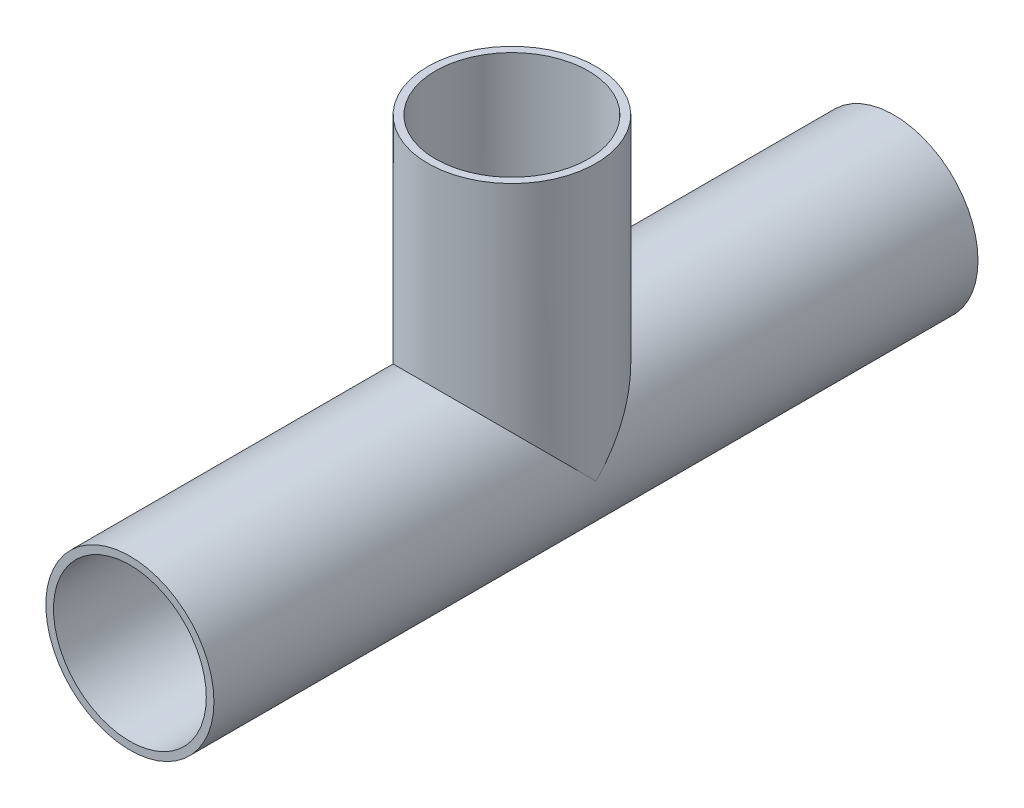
from build123d import *

# Parameters (mm, degrees)
SKIZZE1_R                         = 55
SKIZZE1_R_2                       = 50
LINEAR_AUSTRAGEN_D_NN1_DEPTH      = 250
LINEAR_AUSTRAGEN_D_NN2_REACH      = 349.491
LINEAR_AUSTRAGEN_D_NN2_END_RADIUS = 55
SKIZZE2_R                         = 55
SKIZZE2_R_2                       = 50
SCHNITT_LINEAR_AUSTRAGEN1_REACH   = 349.491
SKIZZE2_2_R                       = 50


with BuildPart() as part:
    # Skizze1 → Linear-Austragen-D_nn1 (new, symmetric)
    with BuildSketch(Plane.XY):
        Circle(SKIZZE1_R)
        Circle(SKIZZE1_R_2, mode=Mode.SUBTRACT)
    extrude(amount=LINEAR_AUSTRAGEN_D_NN1_DEPTH, both=True)

    # Linear-Austragen-D_nn2: up to this cylinder (the profile starts outside it)
    linear_austragen_d_nn2_end = Plane(origin=(0, 0, 0), z_dir=(0, 0, -1)) * Cylinder(LINEAR_AUSTRAGEN_D_NN2_END_RADIUS, 809.982, mode=Mode.PRIVATE)
    # Skizze2 → Linear-Austragen-D_nn2 (add, up to the surface)
    with BuildSketch(Plane(origin=(0, 180, 0), x_dir=(-1, 0, 0), z_dir=(0, 1, 0)), mode=Mode.PRIVATE) as linear_austragen_d_nn2_sk1:
        Circle(SKIZZE2_R)
        Circle(SKIZZE2_R_2, mode=Mode.SUBTRACT)
    linear_austragen_d_nn2_tool1 = extrude(linear_austragen_d_nn2_sk1.sketch, amount=-LINEAR_AUSTRAGEN_D_NN2_REACH, mode=Mode.PRIVATE) - linear_austragen_d_nn2_end
    add(linear_austragen_d_nn2_tool1.solids().sort_by_distance((53.444365, 180, 0))[0])

    # Skizze2_2 → Schnitt-Linear austragen1 (cut, up to next)
    with BuildSketch(Plane(origin=(0, 180, 0), x_dir=(-1, 0, 0), z_dir=(0, 1, 0)), mode=Mode.PRIVATE) as schnitt_linear_austragen1_sk1:
        with Locations(Location((0, 0, 0), (0, 0, 90))):
            Circle(SKIZZE2_2_R)
    schnitt_linear_austragen1_tool1 = extrude(schnitt_linear_austragen1_sk1.sketch, amount=-SCHNITT_LINEAR_AUSTRAGEN1_REACH, mode=Mode.PRIVATE) & part.part
    add(schnitt_linear_austragen1_tool1.solids().sort_by_distance((0, 180, 0))[0], mode=Mode.SUBTRACT)


solid = part.part
